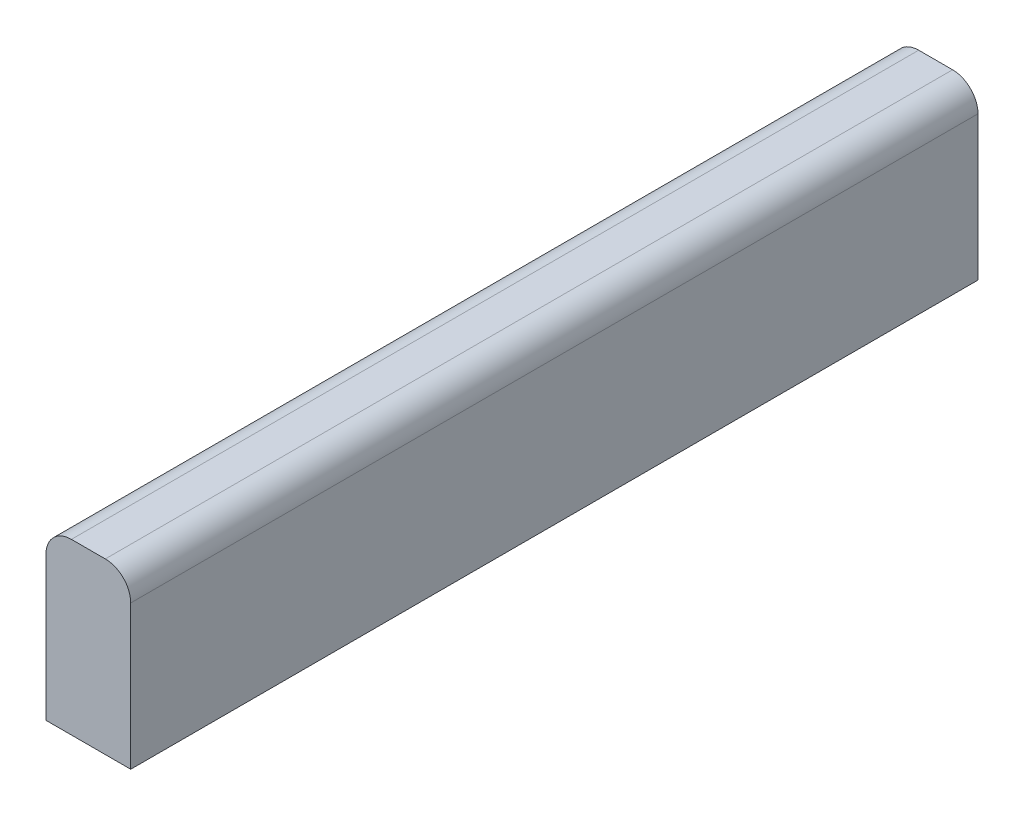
from build123d import *

# Parameters (mm, degrees)
LINEAR_AUSTRAGEN1_DEPTH = 100


with BuildPart() as part:
    # Skizze1 → Linear austragen1 (new body)
    with BuildSketch(Plane.XY):
        with BuildLine():
            Line((0, 0), (10, 0))
            Line((10, 0), (10, 17))
            ThreePointArc((10, 17), (9.121320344, 19.121320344), (7, 20))
            Line((7, 20), (3, 20))
            ThreePointArc((3, 20), (0.878679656, 19.121320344), (0, 17))
            Line((0, 17), (0, 0))
        make_face()
    extrude(amount=LINEAR_AUSTRAGEN1_DEPTH)


solid = part.part
